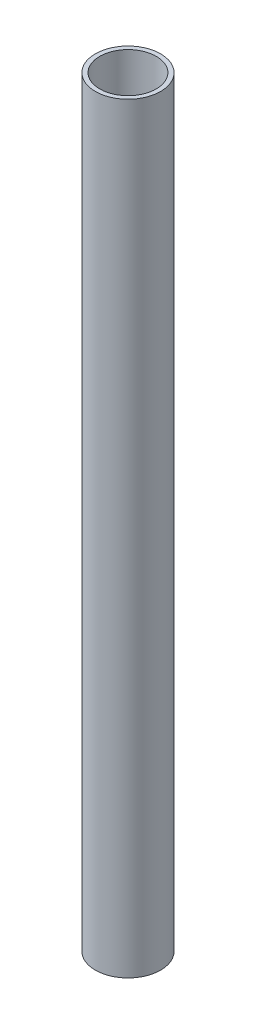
ISO-10303-21;
HEADER;
FILE_DESCRIPTION(('STEP AP214'),'2;1');
FILE_NAME('part.step','',(''),(''),'','','');
FILE_SCHEMA(('AUTOMOTIVE_DESIGN { 1 0 10303 214 1 1 1 1 }'));
ENDSEC;
DATA;
#1=APPLICATION_CONTEXT('core data for automotive mechanical design processes');
#2=APPLICATION_PROTOCOL_DEFINITION('international standard','automotive_design',2000,#1);
#3=PRODUCT_CONTEXT('',#1,'mechanical');
#4=PRODUCT('Part','Part','',(#3));
#5=PRODUCT_RELATED_PRODUCT_CATEGORY('part','',(#4));
#6=PRODUCT_DEFINITION_FORMATION('','',#4);
#7=PRODUCT_DEFINITION_CONTEXT('part definition',#1,'design');
#8=PRODUCT_DEFINITION('design','',#6,#7);
#9=PRODUCT_DEFINITION_SHAPE('','',#8);
#10=(LENGTH_UNIT() NAMED_UNIT(*) SI_UNIT(.MILLI.,.METRE.));
#11=(NAMED_UNIT(*) PLANE_ANGLE_UNIT() SI_UNIT($,.RADIAN.));
#12=(NAMED_UNIT(*) SI_UNIT($,.STERADIAN.) SOLID_ANGLE_UNIT());
#13=UNCERTAINTY_MEASURE_WITH_UNIT(LENGTH_MEASURE(1.E-05),#10,'distance_accuracy_value','');
#14=(GEOMETRIC_REPRESENTATION_CONTEXT(3) GLOBAL_UNCERTAINTY_ASSIGNED_CONTEXT((#13)) GLOBAL_UNIT_ASSIGNED_CONTEXT((#10,
#11,#12)) REPRESENTATION_CONTEXT('',''));
#15=CARTESIAN_POINT('',(0.,0.,0.));
#16=DIRECTION('',(0.,0.,1.));
#17=DIRECTION('',(1.,0.,0.));
#18=AXIS2_PLACEMENT_3D('',#15,#16,#17);
#19=CARTESIAN_POINT('',(0.,350.,0.));
#20=DIRECTION('',(0.,1.,0.));
#21=DIRECTION('',(0.,0.,1.));
#22=AXIS2_PLACEMENT_3D('',#19,#20,#21);
#23=PLANE('',#22);
#24=CARTESIAN_POINT('',(0.,350.,0.));
#25=DIRECTION('',(0.,1.,0.));
#26=DIRECTION('',(0.,0.,1.));
#27=AXIS2_PLACEMENT_3D('',#24,#25,#26);
#28=CIRCLE('',#27,15.);
#29=CARTESIAN_POINT('',(0.,350.,15.));
#30=VERTEX_POINT('',#29);
#31=EDGE_CURVE('E10',#30,#30,#28,.T.);
#32=ORIENTED_EDGE('',*,*,#31,.T.);
#33=EDGE_LOOP('',(#32));
#34=FACE_BOUND('',#33,.T.);
#35=CARTESIAN_POINT('',(0.,350.,0.));
#36=DIRECTION('',(0.,1.,0.));
#37=DIRECTION('',(0.,0.,1.));
#38=AXIS2_PLACEMENT_3D('',#35,#36,#37);
#39=CIRCLE('',#38,13.);
#40=CARTESIAN_POINT('',(0.,350.,13.));
#41=VERTEX_POINT('',#40);
#42=EDGE_CURVE('E40',#41,#41,#39,.T.);
#43=ORIENTED_EDGE('',*,*,#42,.F.);
#44=EDGE_LOOP('',(#43));
#45=FACE_BOUND('',#44,.T.);
#46=ADVANCED_FACE('F29',(#34,#45),#23,.T.);
#47=CARTESIAN_POINT('',(0.,0.,0.));
#48=DIRECTION('',(0.,1.,0.));
#49=DIRECTION('',(0.,0.,1.));
#50=AXIS2_PLACEMENT_3D('',#47,#48,#49);
#51=PLANE('',#50);
#52=CARTESIAN_POINT('',(0.,0.,0.));
#53=DIRECTION('',(0.,1.,0.));
#54=DIRECTION('',(0.,0.,1.));
#55=AXIS2_PLACEMENT_3D('',#52,#53,#54);
#56=CIRCLE('',#55,15.);
#57=CARTESIAN_POINT('',(0.,0.,15.));
#58=VERTEX_POINT('',#57);
#59=EDGE_CURVE('E36',#58,#58,#56,.T.);
#60=ORIENTED_EDGE('',*,*,#59,.F.);
#61=EDGE_LOOP('',(#60));
#62=FACE_BOUND('',#61,.T.);
#63=CARTESIAN_POINT('',(0.,0.,0.));
#64=DIRECTION('',(0.,1.,0.));
#65=DIRECTION('',(0.,0.,1.));
#66=AXIS2_PLACEMENT_3D('',#63,#64,#65);
#67=CIRCLE('',#66,13.);
#68=CARTESIAN_POINT('',(0.,0.,13.));
#69=VERTEX_POINT('',#68);
#70=EDGE_CURVE('E44',#69,#69,#67,.T.);
#71=ORIENTED_EDGE('',*,*,#70,.T.);
#72=EDGE_LOOP('',(#71));
#73=FACE_BOUND('',#72,.T.);
#74=ADVANCED_FACE('F50',(#62,#73),#51,.F.);
#75=CARTESIAN_POINT('',(0.,350.,0.));
#76=DIRECTION('',(0.,-1.,0.));
#77=DIRECTION('',(0.,0.,-1.));
#78=AXIS2_PLACEMENT_3D('',#75,#76,#77);
#79=CYLINDRICAL_SURFACE('',#78,15.);
#80=ORIENTED_EDGE('',*,*,#31,.F.);
#81=EDGE_LOOP('',(#80));
#82=FACE_BOUND('',#81,.T.);
#83=ORIENTED_EDGE('',*,*,#59,.T.);
#84=EDGE_LOOP('',(#83));
#85=FACE_BOUND('',#84,.T.);
#86=ADVANCED_FACE('F31',(#82,#85),#79,.T.);
#87=CARTESIAN_POINT('',(0.,350.,0.));
#88=DIRECTION('',(0.,-1.,0.));
#89=DIRECTION('',(0.,0.,-1.));
#90=AXIS2_PLACEMENT_3D('',#87,#88,#89);
#91=CYLINDRICAL_SURFACE('',#90,13.);
#92=ORIENTED_EDGE('',*,*,#42,.T.);
#93=EDGE_LOOP('',(#92));
#94=FACE_BOUND('',#93,.T.);
#95=ORIENTED_EDGE('',*,*,#70,.F.);
#96=EDGE_LOOP('',(#95));
#97=FACE_BOUND('',#96,.T.);
#98=ADVANCED_FACE('F52',(#94,#97),#91,.F.);
#99=CLOSED_SHELL('',(#46,#74,#86,#98));
#100=MANIFOLD_SOLID_BREP('B2',#99);
#101=ADVANCED_BREP_SHAPE_REPRESENTATION('',(#18,#100),#14);
#102=SHAPE_DEFINITION_REPRESENTATION(#9,#101);
ENDSEC;
END-ISO-10303-21;
